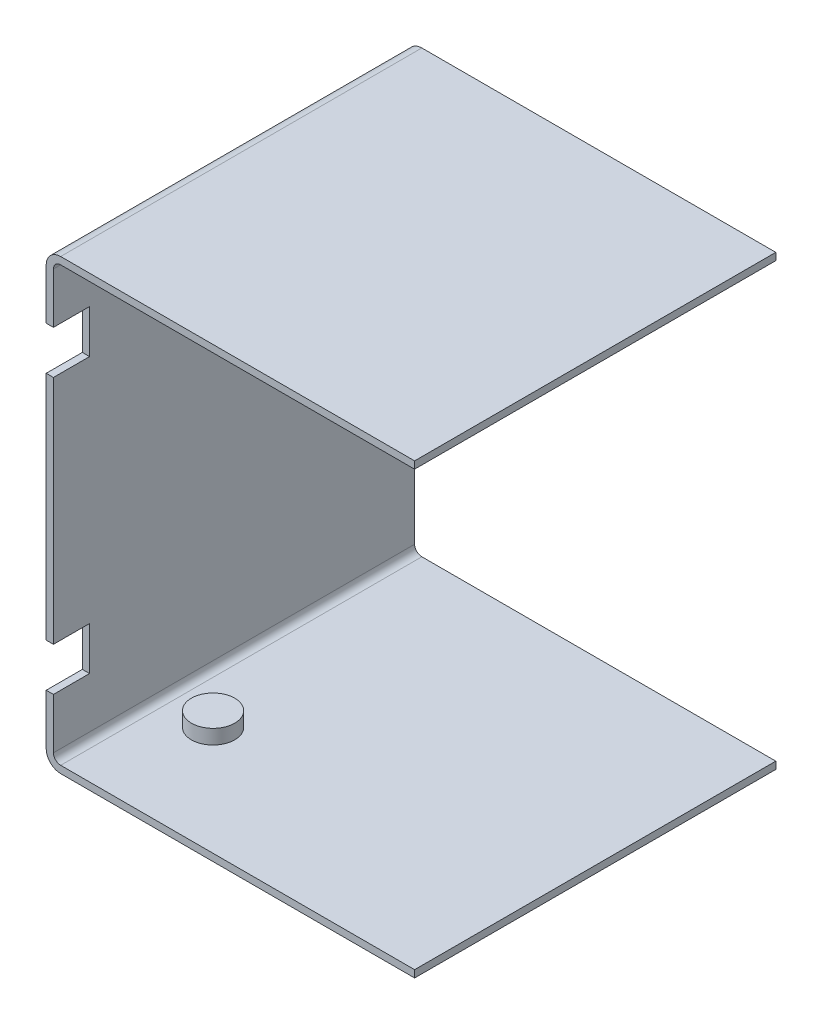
ISO-10303-21;
HEADER;
FILE_DESCRIPTION(('STEP AP214'),'2;1');
FILE_NAME('part.step','',(''),(''),'','','');
FILE_SCHEMA(('AUTOMOTIVE_DESIGN { 1 0 10303 214 1 1 1 1 }'));
ENDSEC;
DATA;
#1=APPLICATION_CONTEXT('core data for automotive mechanical design processes');
#2=APPLICATION_PROTOCOL_DEFINITION('international standard','automotive_design',2000,#1);
#3=PRODUCT_CONTEXT('',#1,'mechanical');
#4=PRODUCT('Part','Part','',(#3));
#5=PRODUCT_RELATED_PRODUCT_CATEGORY('part','',(#4));
#6=PRODUCT_DEFINITION_FORMATION('','',#4);
#7=PRODUCT_DEFINITION_CONTEXT('part definition',#1,'design');
#8=PRODUCT_DEFINITION('design','',#6,#7);
#9=PRODUCT_DEFINITION_SHAPE('','',#8);
#10=(LENGTH_UNIT() NAMED_UNIT(*) SI_UNIT(.MILLI.,.METRE.));
#11=(NAMED_UNIT(*) PLANE_ANGLE_UNIT() SI_UNIT($,.RADIAN.));
#12=(NAMED_UNIT(*) SI_UNIT($,.STERADIAN.) SOLID_ANGLE_UNIT());
#13=UNCERTAINTY_MEASURE_WITH_UNIT(LENGTH_MEASURE(1.E-05),#10,'distance_accuracy_value','');
#14=(GEOMETRIC_REPRESENTATION_CONTEXT(3) GLOBAL_UNCERTAINTY_ASSIGNED_CONTEXT((#13)) GLOBAL_UNIT_ASSIGNED_CONTEXT((#10,
#11,#12)) REPRESENTATION_CONTEXT('',''));
#15=CARTESIAN_POINT('',(0.,0.,0.));
#16=DIRECTION('',(0.,0.,1.));
#17=DIRECTION('',(1.,0.,0.));
#18=AXIS2_PLACEMENT_3D('',#15,#16,#17);
#19=CARTESIAN_POINT('',(-10.,0.,500.));
#20=DIRECTION('',(1.,0.,0.));
#21=DIRECTION('',(0.,0.,-1.));
#22=AXIS2_PLACEMENT_3D('',#19,#20,#21);
#23=PLANE('',#22);
#24=DIRECTION('',(0.,0.,-1.));
#25=VECTOR('',#24,1.);
#26=CARTESIAN_POINT('',(-10.,-160.,500.));
#27=LINE('',#26,#25);
#28=CARTESIAN_POINT('',(-10.,-160.,500.));
#29=VERTEX_POINT('',#28);
#30=CARTESIAN_POINT('',(-10.,-160.,450.));
#31=VERTEX_POINT('',#30);
#32=EDGE_CURVE('E301',#29,#31,#27,.T.);
#33=ORIENTED_EDGE('',*,*,#32,.F.);
#34=DIRECTION('',(0.,-1.,0.));
#35=VECTOR('',#34,1.);
#36=CARTESIAN_POINT('',(-10.,0.,500.));
#37=LINE('',#36,#35);
#38=CARTESIAN_POINT('',(-10.,160.,500.));
#39=VERTEX_POINT('',#38);
#40=EDGE_CURVE('E205',#39,#29,#37,.T.);
#41=ORIENTED_EDGE('',*,*,#40,.F.);
#42=DIRECTION('',(0.,0.,-1.));
#43=VECTOR('',#42,1.);
#44=CARTESIAN_POINT('',(-10.,160.,500.));
#45=LINE('',#44,#43);
#46=CARTESIAN_POINT('',(-10.,160.,450.));
#47=VERTEX_POINT('',#46);
#48=EDGE_CURVE('E52',#39,#47,#45,.T.);
#49=ORIENTED_EDGE('',*,*,#48,.T.);
#50=DIRECTION('',(0.,1.,0.));
#51=VECTOR('',#50,1.);
#52=CARTESIAN_POINT('',(-10.,0.,450.));
#53=LINE('',#52,#51);
#54=CARTESIAN_POINT('',(-10.,220.,450.));
#55=VERTEX_POINT('',#54);
#56=EDGE_CURVE('E236',#47,#55,#53,.T.);
#57=ORIENTED_EDGE('',*,*,#56,.T.);
#58=DIRECTION('',(0.,0.,1.));
#59=VECTOR('',#58,1.);
#60=CARTESIAN_POINT('',(-10.,220.,500.));
#61=LINE('',#60,#59);
#62=CARTESIAN_POINT('',(-10.,220.,500.));
#63=VERTEX_POINT('',#62);
#64=EDGE_CURVE('E239',#55,#63,#61,.T.);
#65=ORIENTED_EDGE('',*,*,#64,.T.);
#66=CARTESIAN_POINT('',(-10.,290.,500.));
#67=VERTEX_POINT('',#66);
#68=EDGE_CURVE('E199',#67,#63,#37,.T.);
#69=ORIENTED_EDGE('',*,*,#68,.F.);
#70=DIRECTION('',(0.,0.,-1.));
#71=VECTOR('',#70,1.);
#72=CARTESIAN_POINT('',(-10.,290.,500.));
#73=LINE('',#72,#71);
#74=CARTESIAN_POINT('',(-10.,290.,0.));
#75=VERTEX_POINT('',#74);
#76=EDGE_CURVE('E357',#67,#75,#73,.T.);
#77=ORIENTED_EDGE('',*,*,#76,.T.);
#78=DIRECTION('',(0.,-1.,0.));
#79=VECTOR('',#78,1.);
#80=CARTESIAN_POINT('',(-10.,0.,0.));
#81=LINE('',#80,#79);
#82=CARTESIAN_POINT('',(-10.,-290.,0.));
#83=VERTEX_POINT('',#82);
#84=EDGE_CURVE('E227',#75,#83,#81,.T.);
#85=ORIENTED_EDGE('',*,*,#84,.T.);
#86=DIRECTION('',(0.,0.,-1.));
#87=VECTOR('',#86,1.);
#88=CARTESIAN_POINT('',(-10.,-290.,500.));
#89=LINE('',#88,#87);
#90=CARTESIAN_POINT('',(-10.,-290.,500.));
#91=VERTEX_POINT('',#90);
#92=EDGE_CURVE('E264',#91,#83,#89,.T.);
#93=ORIENTED_EDGE('',*,*,#92,.F.);
#94=CARTESIAN_POINT('',(-10.,-220.,500.));
#95=VERTEX_POINT('',#94);
#96=EDGE_CURVE('E206',#95,#91,#37,.T.);
#97=ORIENTED_EDGE('',*,*,#96,.F.);
#98=DIRECTION('',(0.,0.,1.));
#99=VECTOR('',#98,1.);
#100=CARTESIAN_POINT('',(-10.,-220.,500.));
#101=LINE('',#100,#99);
#102=CARTESIAN_POINT('',(-10.,-220.,450.));
#103=VERTEX_POINT('',#102);
#104=EDGE_CURVE('E44',#103,#95,#101,.T.);
#105=ORIENTED_EDGE('',*,*,#104,.F.);
#106=DIRECTION('',(0.,-1.,0.));
#107=VECTOR('',#106,1.);
#108=CARTESIAN_POINT('',(-10.,0.,450.));
#109=LINE('',#108,#107);
#110=EDGE_CURVE('E299',#31,#103,#109,.T.);
#111=ORIENTED_EDGE('',*,*,#110,.F.);
#112=EDGE_LOOP('',(#33,#41,#49,#57,#65,#69,#77,#85,#93,#97,#105,#111));
#113=FACE_BOUND('',#112,.T.);
#114=ADVANCED_FACE('F29',(#113),#23,.F.);
#115=CARTESIAN_POINT('',(0.,290.,500.));
#116=DIRECTION('',(-1.,0.,0.));
#117=DIRECTION('',(0.,0.,1.));
#118=AXIS2_PLACEMENT_3D('',#115,#116,#117);
#119=PLANE('',#118);
#120=DIRECTION('',(0.,0.,-1.));
#121=VECTOR('',#120,1.);
#122=CARTESIAN_POINT('',(0.,-160.,500.));
#123=LINE('',#122,#121);
#124=CARTESIAN_POINT('',(0.,-160.,500.));
#125=VERTEX_POINT('',#124);
#126=CARTESIAN_POINT('',(0.,-160.,450.));
#127=VERTEX_POINT('',#126);
#128=EDGE_CURVE('E307',#125,#127,#123,.T.);
#129=ORIENTED_EDGE('',*,*,#128,.T.);
#130=DIRECTION('',(0.,-1.,0.));
#131=VECTOR('',#130,1.);
#132=CARTESIAN_POINT('',(0.,-220.,450.));
#133=LINE('',#132,#131);
#134=CARTESIAN_POINT('',(0.,-220.,450.));
#135=VERTEX_POINT('',#134);
#136=EDGE_CURVE('E184',#127,#135,#133,.T.);
#137=ORIENTED_EDGE('',*,*,#136,.T.);
#138=DIRECTION('',(0.,0.,1.));
#139=VECTOR('',#138,1.);
#140=CARTESIAN_POINT('',(0.,-220.,500.));
#141=LINE('',#140,#139);
#142=CARTESIAN_POINT('',(0.,-220.,500.));
#143=VERTEX_POINT('',#142);
#144=EDGE_CURVE('E170',#135,#143,#141,.T.);
#145=ORIENTED_EDGE('',*,*,#144,.T.);
#146=DIRECTION('',(0.,1.,0.));
#147=VECTOR('',#146,1.);
#148=CARTESIAN_POINT('',(0.,290.,500.));
#149=LINE('',#148,#147);
#150=CARTESIAN_POINT('',(0.,-290.,500.));
#151=VERTEX_POINT('',#150);
#152=EDGE_CURVE('E181',#151,#143,#149,.T.);
#153=ORIENTED_EDGE('',*,*,#152,.F.);
#154=DIRECTION('',(0.,0.,-1.));
#155=VECTOR('',#154,1.);
#156=CARTESIAN_POINT('',(0.,-290.,500.));
#157=LINE('',#156,#155);
#158=CARTESIAN_POINT('',(0.,-290.,0.));
#159=VERTEX_POINT('',#158);
#160=EDGE_CURVE('E262',#151,#159,#157,.T.);
#161=ORIENTED_EDGE('',*,*,#160,.T.);
#162=DIRECTION('',(0.,1.,0.));
#163=VECTOR('',#162,1.);
#164=CARTESIAN_POINT('',(0.,290.,0.));
#165=LINE('',#164,#163);
#166=CARTESIAN_POINT('',(0.,290.,0.));
#167=VERTEX_POINT('',#166);
#168=EDGE_CURVE('E225',#159,#167,#165,.T.);
#169=ORIENTED_EDGE('',*,*,#168,.T.);
#170=DIRECTION('',(0.,0.,-1.));
#171=VECTOR('',#170,1.);
#172=CARTESIAN_POINT('',(0.,290.,500.));
#173=LINE('',#172,#171);
#174=CARTESIAN_POINT('',(0.,290.,500.));
#175=VERTEX_POINT('',#174);
#176=EDGE_CURVE('E379',#175,#167,#173,.T.);
#177=ORIENTED_EDGE('',*,*,#176,.F.);
#178=CARTESIAN_POINT('',(0.,220.,500.));
#179=VERTEX_POINT('',#178);
#180=EDGE_CURVE('E195',#179,#175,#149,.T.);
#181=ORIENTED_EDGE('',*,*,#180,.F.);
#182=DIRECTION('',(0.,0.,1.));
#183=VECTOR('',#182,1.);
#184=CARTESIAN_POINT('',(0.,220.,500.));
#185=LINE('',#184,#183);
#186=CARTESIAN_POINT('',(0.,220.,450.));
#187=VERTEX_POINT('',#186);
#188=EDGE_CURVE('E246',#187,#179,#185,.T.);
#189=ORIENTED_EDGE('',*,*,#188,.F.);
#190=DIRECTION('',(0.,1.,0.));
#191=VECTOR('',#190,1.);
#192=CARTESIAN_POINT('',(0.,220.,450.));
#193=LINE('',#192,#191);
#194=CARTESIAN_POINT('',(0.,160.,450.));
#195=VERTEX_POINT('',#194);
#196=EDGE_CURVE('E249',#195,#187,#193,.T.);
#197=ORIENTED_EDGE('',*,*,#196,.F.);
#198=DIRECTION('',(0.,0.,-1.));
#199=VECTOR('',#198,1.);
#200=CARTESIAN_POINT('',(0.,160.,500.));
#201=LINE('',#200,#199);
#202=CARTESIAN_POINT('',(0.,160.,500.));
#203=VERTEX_POINT('',#202);
#204=EDGE_CURVE('E252',#203,#195,#201,.T.);
#205=ORIENTED_EDGE('',*,*,#204,.F.);
#206=EDGE_CURVE('E193',#125,#203,#149,.T.);
#207=ORIENTED_EDGE('',*,*,#206,.F.);
#208=EDGE_LOOP('',(#129,#137,#145,#153,#161,#169,#177,#181,#189,#197,#205,#207));
#209=FACE_BOUND('',#208,.T.);
#210=ADVANCED_FACE('F179',(#209),#119,.F.);
#211=CARTESIAN_POINT('',(10.,290.,500.));
#212=DIRECTION('',(0.,0.,1.));
#213=DIRECTION('',(1.,0.,0.));
#214=AXIS2_PLACEMENT_3D('',#211,#212,#213);
#215=PLANE('',#214);
#216=ORIENTED_EDGE('',*,*,#40,.T.);
#217=DIRECTION('',(1.,0.,0.));
#218=VECTOR('',#217,1.);
#219=CARTESIAN_POINT('',(10.,-160.,500.));
#220=LINE('',#219,#218);
#221=EDGE_CURVE('E37',#29,#125,#220,.T.);
#222=ORIENTED_EDGE('',*,*,#221,.T.);
#223=ORIENTED_EDGE('',*,*,#206,.T.);
#224=DIRECTION('',(1.,0.,0.));
#225=VECTOR('',#224,1.);
#226=CARTESIAN_POINT('',(10.,160.,500.));
#227=LINE('',#226,#225);
#228=EDGE_CURVE('E402',#39,#203,#227,.T.);
#229=ORIENTED_EDGE('',*,*,#228,.F.);
#230=EDGE_LOOP('',(#216,#222,#223,#229));
#231=FACE_BOUND('',#230,.T.);
#232=ADVANCED_FACE('F330',(#231),#215,.T.);
#233=ORIENTED_EDGE('',*,*,#152,.T.);
#234=DIRECTION('',(-1.,0.,0.));
#235=VECTOR('',#234,1.);
#236=CARTESIAN_POINT('',(10.,-220.,500.));
#237=LINE('',#236,#235);
#238=EDGE_CURVE('E167',#143,#95,#237,.T.);
#239=ORIENTED_EDGE('',*,*,#238,.T.);
#240=ORIENTED_EDGE('',*,*,#96,.T.);
#241=CARTESIAN_POINT('',(9.99999999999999,-290.,500.));
#242=DIRECTION('',(0.,0.,-1.));
#243=DIRECTION('',(-1.,0.,0.));
#244=AXIS2_PLACEMENT_3D('',#241,#242,#243);
#245=CIRCLE('',#244,20.);
#246=CARTESIAN_POINT('',(10.0000000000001,-310.,500.));
#247=VERTEX_POINT('',#246);
#248=EDGE_CURVE('E274',#247,#91,#245,.T.);
#249=ORIENTED_EDGE('',*,*,#248,.F.);
#250=DIRECTION('',(-1.,0.,0.));
#251=VECTOR('',#250,1.);
#252=CARTESIAN_POINT('',(10.0000000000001,-310.,500.));
#253=LINE('',#252,#251);
#254=CARTESIAN_POINT('',(500.,-310.,500.));
#255=VERTEX_POINT('',#254);
#256=EDGE_CURVE('E271',#255,#247,#253,.T.);
#257=ORIENTED_EDGE('',*,*,#256,.F.);
#258=DIRECTION('',(0.,-1.,0.));
#259=VECTOR('',#258,1.);
#260=CARTESIAN_POINT('',(500.,-310.,500.));
#261=LINE('',#260,#259);
#262=CARTESIAN_POINT('',(500.,-300.,500.));
#263=VERTEX_POINT('',#262);
#264=EDGE_CURVE('E281',#263,#255,#261,.T.);
#265=ORIENTED_EDGE('',*,*,#264,.F.);
#266=DIRECTION('',(1.,0.,0.));
#267=VECTOR('',#266,1.);
#268=CARTESIAN_POINT('',(500.,-300.,500.));
#269=LINE('',#268,#267);
#270=CARTESIAN_POINT('',(10.0000000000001,-300.,500.));
#271=VERTEX_POINT('',#270);
#272=EDGE_CURVE('E278',#271,#263,#269,.T.);
#273=ORIENTED_EDGE('',*,*,#272,.F.);
#274=CARTESIAN_POINT('',(10.,-290.,500.));
#275=DIRECTION('',(0.,0.,1.));
#276=DIRECTION('',(1.,0.,0.));
#277=AXIS2_PLACEMENT_3D('',#274,#275,#276);
#278=CIRCLE('',#277,10.);
#279=EDGE_CURVE('E191',#151,#271,#278,.T.);
#280=ORIENTED_EDGE('',*,*,#279,.F.);
#281=EDGE_LOOP('',(#233,#239,#240,#249,#257,#265,#273,#280));
#282=FACE_BOUND('',#281,.T.);
#283=ADVANCED_FACE('F188',(#282),#215,.T.);
#284=CARTESIAN_POINT('',(500.,300.,500.));
#285=DIRECTION('',(0.,1.,0.));
#286=DIRECTION('',(-1.,0.,0.));
#287=AXIS2_PLACEMENT_3D('',#284,#285,#286);
#288=PLANE('',#287);
#289=DIRECTION('',(1.,0.,0.));
#290=VECTOR('',#289,1.);
#291=CARTESIAN_POINT('',(500.,300.,0.));
#292=LINE('',#291,#290);
#293=CARTESIAN_POINT('',(10.0000000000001,300.,0.));
#294=VERTEX_POINT('',#293);
#295=CARTESIAN_POINT('',(500.,300.,0.));
#296=VERTEX_POINT('',#295);
#297=EDGE_CURVE('E221',#294,#296,#292,.T.);
#298=ORIENTED_EDGE('',*,*,#297,.T.);
#299=DIRECTION('',(0.,0.,-1.));
#300=VECTOR('',#299,1.);
#301=CARTESIAN_POINT('',(500.,300.,500.));
#302=LINE('',#301,#300);
#303=CARTESIAN_POINT('',(500.,300.,500.));
#304=VERTEX_POINT('',#303);
#305=EDGE_CURVE('E394',#304,#296,#302,.T.);
#306=ORIENTED_EDGE('',*,*,#305,.F.);
#307=DIRECTION('',(1.,0.,0.));
#308=VECTOR('',#307,1.);
#309=CARTESIAN_POINT('',(500.,300.,500.));
#310=LINE('',#309,#308);
#311=CARTESIAN_POINT('',(10.0000000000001,300.,500.));
#312=VERTEX_POINT('',#311);
#313=EDGE_CURVE('E196',#312,#304,#310,.T.);
#314=ORIENTED_EDGE('',*,*,#313,.F.);
#315=DIRECTION('',(0.,0.,-1.));
#316=VECTOR('',#315,1.);
#317=CARTESIAN_POINT('',(10.0000000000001,300.,500.));
#318=LINE('',#317,#316);
#319=EDGE_CURVE('E385',#312,#294,#318,.T.);
#320=ORIENTED_EDGE('',*,*,#319,.T.);
#321=EDGE_LOOP('',(#298,#306,#314,#320));
#322=FACE_BOUND('',#321,.T.);
#323=CARTESIAN_POINT('',(69.9999999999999,300.,349.));
#324=DIRECTION('',(0.,1.,0.));
#325=DIRECTION('',(-1.,0.,0.));
#326=AXIS2_PLACEMENT_3D('',#323,#324,#325);
#327=CIRCLE('',#326,30.);
#328=CARTESIAN_POINT('',(39.9999999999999,300.,349.));
#329=VERTEX_POINT('',#328);
#330=EDGE_CURVE('E175',#329,#329,#327,.F.);
#331=ORIENTED_EDGE('',*,*,#330,.F.);
#332=EDGE_LOOP('',(#331));
#333=FACE_BOUND('',#332,.T.);
#334=ADVANCED_FACE('F391',(#322,#333),#288,.F.);
#335=DIRECTION('',(-1.,0.,0.));
#336=VECTOR('',#335,1.);
#337=CARTESIAN_POINT('',(10.,220.,500.));
#338=LINE('',#337,#336);
#339=EDGE_CURVE('E404',#179,#63,#338,.T.);
#340=ORIENTED_EDGE('',*,*,#339,.F.);
#341=ORIENTED_EDGE('',*,*,#180,.T.);
#342=CARTESIAN_POINT('',(10.,290.,500.));
#343=DIRECTION('',(0.,0.,-1.));
#344=DIRECTION('',(1.,0.,0.));
#345=AXIS2_PLACEMENT_3D('',#342,#343,#344);
#346=CIRCLE('',#345,10.);
#347=EDGE_CURVE('E192',#175,#312,#346,.T.);
#348=ORIENTED_EDGE('',*,*,#347,.T.);
#349=ORIENTED_EDGE('',*,*,#313,.T.);
#350=DIRECTION('',(0.,1.,0.));
#351=VECTOR('',#350,1.);
#352=CARTESIAN_POINT('',(500.,310.,500.));
#353=LINE('',#352,#351);
#354=CARTESIAN_POINT('',(500.,310.,500.));
#355=VERTEX_POINT('',#354);
#356=EDGE_CURVE('E216',#304,#355,#353,.T.);
#357=ORIENTED_EDGE('',*,*,#356,.T.);
#358=DIRECTION('',(-1.,0.,0.));
#359=VECTOR('',#358,1.);
#360=CARTESIAN_POINT('',(10.0000000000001,310.,500.));
#361=LINE('',#360,#359);
#362=CARTESIAN_POINT('',(10.0000000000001,310.,500.));
#363=VERTEX_POINT('',#362);
#364=EDGE_CURVE('E213',#355,#363,#361,.T.);
#365=ORIENTED_EDGE('',*,*,#364,.T.);
#366=CARTESIAN_POINT('',(9.99999999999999,290.,500.));
#367=DIRECTION('',(0.,0.,1.));
#368=DIRECTION('',(-1.,0.,0.));
#369=AXIS2_PLACEMENT_3D('',#366,#367,#368);
#370=CIRCLE('',#369,20.);
#371=EDGE_CURVE('E210',#363,#67,#370,.T.);
#372=ORIENTED_EDGE('',*,*,#371,.T.);
#373=ORIENTED_EDGE('',*,*,#68,.T.);
#374=EDGE_LOOP('',(#340,#341,#348,#349,#357,#365,#372,#373));
#375=FACE_BOUND('',#374,.T.);
#376=ADVANCED_FACE('F345',(#375),#215,.T.);
#377=CARTESIAN_POINT('',(500.,310.,500.));
#378=DIRECTION('',(-1.,0.,0.));
#379=DIRECTION('',(0.,-1.,0.));
#380=AXIS2_PLACEMENT_3D('',#377,#378,#379);
#381=PLANE('',#380);
#382=DIRECTION('',(0.,1.,0.));
#383=VECTOR('',#382,1.);
#384=CARTESIAN_POINT('',(500.,310.,0.));
#385=LINE('',#384,#383);
#386=CARTESIAN_POINT('',(500.,310.,0.));
#387=VERTEX_POINT('',#386);
#388=EDGE_CURVE('E233',#296,#387,#385,.T.);
#389=ORIENTED_EDGE('',*,*,#388,.T.);
#390=DIRECTION('',(0.,0.,-1.));
#391=VECTOR('',#390,1.);
#392=CARTESIAN_POINT('',(500.,310.,500.));
#393=LINE('',#392,#391);
#394=EDGE_CURVE('E352',#355,#387,#393,.T.);
#395=ORIENTED_EDGE('',*,*,#394,.F.);
#396=ORIENTED_EDGE('',*,*,#356,.F.);
#397=ORIENTED_EDGE('',*,*,#305,.T.);
#398=EDGE_LOOP('',(#389,#395,#396,#397));
#399=FACE_BOUND('',#398,.T.);
#400=ADVANCED_FACE('F31',(#399),#381,.F.);
#401=CARTESIAN_POINT('',(10.0000000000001,310.,500.));
#402=DIRECTION('',(0.,-1.,0.));
#403=DIRECTION('',(0.,0.,-1.));
#404=AXIS2_PLACEMENT_3D('',#401,#402,#403);
#405=PLANE('',#404);
#406=DIRECTION('',(-1.,0.,0.));
#407=VECTOR('',#406,1.);
#408=CARTESIAN_POINT('',(10.0000000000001,310.,0.));
#409=LINE('',#408,#407);
#410=CARTESIAN_POINT('',(10.0000000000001,310.,0.));
#411=VERTEX_POINT('',#410);
#412=EDGE_CURVE('E231',#387,#411,#409,.T.);
#413=ORIENTED_EDGE('',*,*,#412,.T.);
#414=DIRECTION('',(0.,0.,-1.));
#415=VECTOR('',#414,1.);
#416=CARTESIAN_POINT('',(10.0000000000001,310.,500.));
#417=LINE('',#416,#415);
#418=EDGE_CURVE('E350',#363,#411,#417,.T.);
#419=ORIENTED_EDGE('',*,*,#418,.F.);
#420=ORIENTED_EDGE('',*,*,#364,.F.);
#421=ORIENTED_EDGE('',*,*,#394,.T.);
#422=EDGE_LOOP('',(#413,#419,#420,#421));
#423=FACE_BOUND('',#422,.T.);
#424=ADVANCED_FACE('F338',(#423),#405,.F.);
#425=CARTESIAN_POINT('',(9.99999999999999,290.,500.));
#426=DIRECTION('',(0.,0.,-1.));
#427=DIRECTION('',(-1.,0.,0.));
#428=AXIS2_PLACEMENT_3D('',#425,#426,#427);
#429=CYLINDRICAL_SURFACE('',#428,20.);
#430=CARTESIAN_POINT('',(9.99999999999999,290.,0.));
#431=DIRECTION('',(0.,0.,1.));
#432=DIRECTION('',(-1.,0.,0.));
#433=AXIS2_PLACEMENT_3D('',#430,#431,#432);
#434=CIRCLE('',#433,20.);
#435=EDGE_CURVE('E229',#411,#75,#434,.T.);
#436=ORIENTED_EDGE('',*,*,#435,.T.);
#437=ORIENTED_EDGE('',*,*,#76,.F.);
#438=ORIENTED_EDGE('',*,*,#371,.F.);
#439=ORIENTED_EDGE('',*,*,#418,.T.);
#440=EDGE_LOOP('',(#436,#437,#438,#439));
#441=FACE_BOUND('',#440,.T.);
#442=ADVANCED_FACE('F335',(#441),#429,.T.);
#443=CARTESIAN_POINT('',(10.,290.,500.));
#444=DIRECTION('',(0.,0.,-1.));
#445=DIRECTION('',(-1.,0.,0.));
#446=AXIS2_PLACEMENT_3D('',#443,#444,#445);
#447=CYLINDRICAL_SURFACE('',#446,10.);
#448=CARTESIAN_POINT('',(10.,290.,0.));
#449=DIRECTION('',(0.,0.,-1.));
#450=DIRECTION('',(1.,0.,0.));
#451=AXIS2_PLACEMENT_3D('',#448,#449,#450);
#452=CIRCLE('',#451,10.);
#453=EDGE_CURVE('E223',#167,#294,#452,.T.);
#454=ORIENTED_EDGE('',*,*,#453,.T.);
#455=ORIENTED_EDGE('',*,*,#319,.F.);
#456=ORIENTED_EDGE('',*,*,#347,.F.);
#457=ORIENTED_EDGE('',*,*,#176,.T.);
#458=EDGE_LOOP('',(#454,#455,#456,#457));
#459=FACE_BOUND('',#458,.T.);
#460=ADVANCED_FACE('F337',(#459),#447,.F.);
#461=CARTESIAN_POINT('',(10.,290.,0.));
#462=DIRECTION('',(0.,0.,1.));
#463=DIRECTION('',(1.,0.,0.));
#464=AXIS2_PLACEMENT_3D('',#461,#462,#463);
#465=PLANE('',#464);
#466=ORIENTED_EDGE('',*,*,#388,.F.);
#467=ORIENTED_EDGE('',*,*,#297,.F.);
#468=ORIENTED_EDGE('',*,*,#453,.F.);
#469=ORIENTED_EDGE('',*,*,#168,.F.);
#470=CARTESIAN_POINT('',(10.,-290.,0.));
#471=DIRECTION('',(0.,0.,1.));
#472=DIRECTION('',(1.,0.,0.));
#473=AXIS2_PLACEMENT_3D('',#470,#471,#472);
#474=CIRCLE('',#473,10.);
#475=CARTESIAN_POINT('',(10.0000000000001,-300.,0.));
#476=VERTEX_POINT('',#475);
#477=EDGE_CURVE('E290',#159,#476,#474,.T.);
#478=ORIENTED_EDGE('',*,*,#477,.T.);
#479=DIRECTION('',(1.,0.,0.));
#480=VECTOR('',#479,1.);
#481=CARTESIAN_POINT('',(500.,-300.,0.));
#482=LINE('',#481,#480);
#483=CARTESIAN_POINT('',(500.,-300.,0.));
#484=VERTEX_POINT('',#483);
#485=EDGE_CURVE('E293',#476,#484,#482,.T.);
#486=ORIENTED_EDGE('',*,*,#485,.T.);
#487=DIRECTION('',(0.,-1.,0.));
#488=VECTOR('',#487,1.);
#489=CARTESIAN_POINT('',(500.,-310.,0.));
#490=LINE('',#489,#488);
#491=CARTESIAN_POINT('',(500.,-310.,0.));
#492=VERTEX_POINT('',#491);
#493=EDGE_CURVE('E296',#484,#492,#490,.T.);
#494=ORIENTED_EDGE('',*,*,#493,.T.);
#495=DIRECTION('',(-1.,0.,0.));
#496=VECTOR('',#495,1.);
#497=CARTESIAN_POINT('',(10.0000000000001,-310.,0.));
#498=LINE('',#497,#496);
#499=CARTESIAN_POINT('',(10.0000000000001,-310.,0.));
#500=VERTEX_POINT('',#499);
#501=EDGE_CURVE('E284',#492,#500,#498,.T.);
#502=ORIENTED_EDGE('',*,*,#501,.T.);
#503=CARTESIAN_POINT('',(9.99999999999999,-290.,0.));
#504=DIRECTION('',(0.,0.,-1.));
#505=DIRECTION('',(-1.,0.,0.));
#506=AXIS2_PLACEMENT_3D('',#503,#504,#505);
#507=CIRCLE('',#506,20.);
#508=EDGE_CURVE('E287',#500,#83,#507,.T.);
#509=ORIENTED_EDGE('',*,*,#508,.T.);
#510=ORIENTED_EDGE('',*,*,#84,.F.);
#511=ORIENTED_EDGE('',*,*,#435,.F.);
#512=ORIENTED_EDGE('',*,*,#412,.F.);
#513=EDGE_LOOP('',(#466,#467,#468,#469,#478,#486,#494,#502,#509,#510,#511,#512));
#514=FACE_BOUND('',#513,.T.);
#515=ADVANCED_FACE('F360',(#514),#465,.F.);
#516=CARTESIAN_POINT('',(-1000.,220.,450.));
#517=DIRECTION('',(0.,0.,-1.));
#518=DIRECTION('',(0.,1.,0.));
#519=AXIS2_PLACEMENT_3D('',#516,#517,#518);
#520=PLANE('',#519);
#521=DIRECTION('',(1.,0.,0.));
#522=VECTOR('',#521,1.);
#523=CARTESIAN_POINT('',(-1000.,160.,450.));
#524=LINE('',#523,#522);
#525=EDGE_CURVE('E244',#47,#195,#524,.T.);
#526=ORIENTED_EDGE('',*,*,#525,.T.);
#527=ORIENTED_EDGE('',*,*,#196,.T.);
#528=DIRECTION('',(1.,0.,0.));
#529=VECTOR('',#528,1.);
#530=CARTESIAN_POINT('',(-1000.,220.,450.));
#531=LINE('',#530,#529);
#532=EDGE_CURVE('E243',#55,#187,#531,.T.);
#533=ORIENTED_EDGE('',*,*,#532,.F.);
#534=ORIENTED_EDGE('',*,*,#56,.F.);
#535=EDGE_LOOP('',(#526,#527,#533,#534));
#536=FACE_BOUND('',#535,.T.);
#537=ADVANCED_FACE('F452',(#536),#520,.F.);
#538=CARTESIAN_POINT('',(-1000.,220.,500.));
#539=DIRECTION('',(0.,1.,0.));
#540=DIRECTION('',(0.,0.,1.));
#541=AXIS2_PLACEMENT_3D('',#538,#539,#540);
#542=PLANE('',#541);
#543=ORIENTED_EDGE('',*,*,#532,.T.);
#544=ORIENTED_EDGE('',*,*,#188,.T.);
#545=ORIENTED_EDGE('',*,*,#339,.T.);
#546=ORIENTED_EDGE('',*,*,#64,.F.);
#547=EDGE_LOOP('',(#543,#544,#545,#546));
#548=FACE_BOUND('',#547,.T.);
#549=ADVANCED_FACE('F449',(#548),#542,.F.);
#550=CARTESIAN_POINT('',(-1000.,160.,500.));
#551=DIRECTION('',(0.,-1.,0.));
#552=DIRECTION('',(0.,0.,-1.));
#553=AXIS2_PLACEMENT_3D('',#550,#551,#552);
#554=PLANE('',#553);
#555=ORIENTED_EDGE('',*,*,#228,.T.);
#556=ORIENTED_EDGE('',*,*,#204,.T.);
#557=ORIENTED_EDGE('',*,*,#525,.F.);
#558=ORIENTED_EDGE('',*,*,#48,.F.);
#559=EDGE_LOOP('',(#555,#556,#557,#558));
#560=FACE_BOUND('',#559,.T.);
#561=ADVANCED_FACE('F415',(#560),#554,.F.);
#562=CARTESIAN_POINT('',(69.9999999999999,280.,349.));
#563=DIRECTION('',(0.,1.,0.));
#564=DIRECTION('',(-1.,0.,0.));
#565=AXIS2_PLACEMENT_3D('',#562,#563,#564);
#566=CYLINDRICAL_SURFACE('',#565,30.);
#567=CARTESIAN_POINT('',(69.9999999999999,280.,349.));
#568=DIRECTION('',(0.,-1.,0.));
#569=DIRECTION('',(1.,0.,0.));
#570=AXIS2_PLACEMENT_3D('',#567,#568,#569);
#571=CIRCLE('',#570,30.);
#572=CARTESIAN_POINT('',(99.9999999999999,280.,349.));
#573=VERTEX_POINT('',#572);
#574=EDGE_CURVE('E255',#573,#573,#571,.T.);
#575=ORIENTED_EDGE('',*,*,#574,.F.);
#576=EDGE_LOOP('',(#575));
#577=FACE_BOUND('',#576,.T.);
#578=ORIENTED_EDGE('',*,*,#330,.T.);
#579=EDGE_LOOP('',(#578));
#580=FACE_BOUND('',#579,.T.);
#581=ADVANCED_FACE('F444',(#577,#580),#566,.T.);
#582=CARTESIAN_POINT('',(69.9999999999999,280.,349.));
#583=DIRECTION('',(0.,-1.,0.));
#584=DIRECTION('',(1.,0.,0.));
#585=AXIS2_PLACEMENT_3D('',#582,#583,#584);
#586=PLANE('',#585);
#587=ORIENTED_EDGE('',*,*,#574,.T.);
#588=EDGE_LOOP('',(#587));
#589=FACE_BOUND('',#588,.T.);
#590=ADVANCED_FACE('F441',(#589),#586,.T.);
#591=CARTESIAN_POINT('',(500.,-310.,500.));
#592=DIRECTION('',(1.,0.,0.));
#593=DIRECTION('',(0.,1.,0.));
#594=AXIS2_PLACEMENT_3D('',#591,#592,#593);
#595=PLANE('',#594);
#596=ORIENTED_EDGE('',*,*,#493,.F.);
#597=DIRECTION('',(0.,0.,-1.));
#598=VECTOR('',#597,1.);
#599=CARTESIAN_POINT('',(500.,-300.,500.));
#600=LINE('',#599,#598);
#601=EDGE_CURVE('E258',#263,#484,#600,.T.);
#602=ORIENTED_EDGE('',*,*,#601,.F.);
#603=ORIENTED_EDGE('',*,*,#264,.T.);
#604=DIRECTION('',(0.,0.,-1.));
#605=VECTOR('',#604,1.);
#606=CARTESIAN_POINT('',(500.,-310.,500.));
#607=LINE('',#606,#605);
#608=EDGE_CURVE('E269',#255,#492,#607,.T.);
#609=ORIENTED_EDGE('',*,*,#608,.T.);
#610=EDGE_LOOP('',(#596,#602,#603,#609));
#611=FACE_BOUND('',#610,.T.);
#612=ADVANCED_FACE('F371',(#611),#595,.T.);
#613=CARTESIAN_POINT('',(500.,-300.,500.));
#614=DIRECTION('',(0.,1.,0.));
#615=DIRECTION('',(-1.,0.,0.));
#616=AXIS2_PLACEMENT_3D('',#613,#614,#615);
#617=PLANE('',#616);
#618=CARTESIAN_POINT('',(69.9999999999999,-300.,349.));
#619=DIRECTION('',(0.,1.,0.));
#620=DIRECTION('',(-1.,0.,0.));
#621=AXIS2_PLACEMENT_3D('',#618,#619,#620);
#622=CIRCLE('',#621,30.);
#623=CARTESIAN_POINT('',(39.9999999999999,-300.,349.));
#624=VERTEX_POINT('',#623);
#625=EDGE_CURVE('E11',#624,#624,#622,.T.);
#626=ORIENTED_EDGE('',*,*,#625,.F.);
#627=EDGE_LOOP('',(#626));
#628=FACE_BOUND('',#627,.T.);
#629=ORIENTED_EDGE('',*,*,#485,.F.);
#630=DIRECTION('',(0.,0.,-1.));
#631=VECTOR('',#630,1.);
#632=CARTESIAN_POINT('',(10.0000000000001,-300.,500.));
#633=LINE('',#632,#631);
#634=EDGE_CURVE('E260',#271,#476,#633,.T.);
#635=ORIENTED_EDGE('',*,*,#634,.F.);
#636=ORIENTED_EDGE('',*,*,#272,.T.);
#637=ORIENTED_EDGE('',*,*,#601,.T.);
#638=EDGE_LOOP('',(#629,#635,#636,#637));
#639=FACE_BOUND('',#638,.T.);
#640=ADVANCED_FACE('F374',(#628,#639),#617,.T.);
#641=CARTESIAN_POINT('',(10.,-290.,500.));
#642=DIRECTION('',(0.,0.,-1.));
#643=DIRECTION('',(-1.,0.,0.));
#644=AXIS2_PLACEMENT_3D('',#641,#642,#643);
#645=CYLINDRICAL_SURFACE('',#644,10.);
#646=ORIENTED_EDGE('',*,*,#477,.F.);
#647=ORIENTED_EDGE('',*,*,#160,.F.);
#648=ORIENTED_EDGE('',*,*,#279,.T.);
#649=ORIENTED_EDGE('',*,*,#634,.T.);
#650=EDGE_LOOP('',(#646,#647,#648,#649));
#651=FACE_BOUND('',#650,.T.);
#652=ADVANCED_FACE('F377',(#651),#645,.F.);
#653=CARTESIAN_POINT('',(9.99999999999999,-290.,500.));
#654=DIRECTION('',(0.,0.,-1.));
#655=DIRECTION('',(-1.,0.,0.));
#656=AXIS2_PLACEMENT_3D('',#653,#654,#655);
#657=CYLINDRICAL_SURFACE('',#656,20.);
#658=ORIENTED_EDGE('',*,*,#508,.F.);
#659=DIRECTION('',(0.,0.,-1.));
#660=VECTOR('',#659,1.);
#661=CARTESIAN_POINT('',(10.0000000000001,-310.,500.));
#662=LINE('',#661,#660);
#663=EDGE_CURVE('E267',#247,#500,#662,.T.);
#664=ORIENTED_EDGE('',*,*,#663,.F.);
#665=ORIENTED_EDGE('',*,*,#248,.T.);
#666=ORIENTED_EDGE('',*,*,#92,.T.);
#667=EDGE_LOOP('',(#658,#664,#665,#666));
#668=FACE_BOUND('',#667,.T.);
#669=ADVANCED_FACE('F363',(#668),#657,.T.);
#670=CARTESIAN_POINT('',(10.0000000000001,-310.,500.));
#671=DIRECTION('',(0.,-1.,0.));
#672=DIRECTION('',(0.,0.,-1.));
#673=AXIS2_PLACEMENT_3D('',#670,#671,#672);
#674=PLANE('',#673);
#675=ORIENTED_EDGE('',*,*,#501,.F.);
#676=ORIENTED_EDGE('',*,*,#608,.F.);
#677=ORIENTED_EDGE('',*,*,#256,.T.);
#678=ORIENTED_EDGE('',*,*,#663,.T.);
#679=EDGE_LOOP('',(#675,#676,#677,#678));
#680=FACE_BOUND('',#679,.T.);
#681=ADVANCED_FACE('F368',(#680),#674,.T.);
#682=CARTESIAN_POINT('',(-1000.,-220.,450.));
#683=DIRECTION('',(0.,0.,1.));
#684=DIRECTION('',(0.,-1.,0.));
#685=AXIS2_PLACEMENT_3D('',#682,#683,#684);
#686=PLANE('',#685);
#687=ORIENTED_EDGE('',*,*,#110,.T.);
#688=DIRECTION('',(1.,0.,0.));
#689=VECTOR('',#688,1.);
#690=CARTESIAN_POINT('',(-1000.,-220.,450.));
#691=LINE('',#690,#689);
#692=EDGE_CURVE('E305',#103,#135,#691,.T.);
#693=ORIENTED_EDGE('',*,*,#692,.T.);
#694=ORIENTED_EDGE('',*,*,#136,.F.);
#695=DIRECTION('',(1.,0.,0.));
#696=VECTOR('',#695,1.);
#697=CARTESIAN_POINT('',(-1000.,-160.,450.));
#698=LINE('',#697,#696);
#699=EDGE_CURVE('E304',#31,#127,#698,.T.);
#700=ORIENTED_EDGE('',*,*,#699,.F.);
#701=EDGE_LOOP('',(#687,#693,#694,#700));
#702=FACE_BOUND('',#701,.T.);
#703=ADVANCED_FACE('F420',(#702),#686,.T.);
#704=CARTESIAN_POINT('',(-1000.,-160.,500.));
#705=DIRECTION('',(0.,-1.,0.));
#706=DIRECTION('',(0.,0.,-1.));
#707=AXIS2_PLACEMENT_3D('',#704,#705,#706);
#708=PLANE('',#707);
#709=ORIENTED_EDGE('',*,*,#32,.T.);
#710=ORIENTED_EDGE('',*,*,#699,.T.);
#711=ORIENTED_EDGE('',*,*,#128,.F.);
#712=ORIENTED_EDGE('',*,*,#221,.F.);
#713=EDGE_LOOP('',(#709,#710,#711,#712));
#714=FACE_BOUND('',#713,.T.);
#715=ADVANCED_FACE('F418',(#714),#708,.T.);
#716=CARTESIAN_POINT('',(-1000.,-220.,500.));
#717=DIRECTION('',(0.,1.,0.));
#718=DIRECTION('',(0.,0.,1.));
#719=AXIS2_PLACEMENT_3D('',#716,#717,#718);
#720=PLANE('',#719);
#721=ORIENTED_EDGE('',*,*,#104,.T.);
#722=ORIENTED_EDGE('',*,*,#238,.F.);
#723=ORIENTED_EDGE('',*,*,#144,.F.);
#724=ORIENTED_EDGE('',*,*,#692,.F.);
#725=EDGE_LOOP('',(#721,#722,#723,#724));
#726=FACE_BOUND('',#725,.T.);
#727=ADVANCED_FACE('F169',(#726),#720,.T.);
#728=CARTESIAN_POINT('',(69.9999999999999,-280.,349.));
#729=DIRECTION('',(0.,-1.,0.));
#730=DIRECTION('',(1.,0.,0.));
#731=AXIS2_PLACEMENT_3D('',#728,#729,#730);
#732=CYLINDRICAL_SURFACE('',#731,30.);
#733=CARTESIAN_POINT('',(69.9999999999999,-280.,349.));
#734=DIRECTION('',(0.,-1.,0.));
#735=DIRECTION('',(1.,0.,0.));
#736=AXIS2_PLACEMENT_3D('',#733,#734,#735);
#737=CIRCLE('',#736,30.);
#738=CARTESIAN_POINT('',(99.9999999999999,-280.,349.));
#739=VERTEX_POINT('',#738);
#740=EDGE_CURVE('E185',#739,#739,#737,.T.);
#741=ORIENTED_EDGE('',*,*,#740,.T.);
#742=EDGE_LOOP('',(#741));
#743=FACE_BOUND('',#742,.T.);
#744=ORIENTED_EDGE('',*,*,#625,.T.);
#745=EDGE_LOOP('',(#744));
#746=FACE_BOUND('',#745,.T.);
#747=ADVANCED_FACE('F314',(#743,#746),#732,.T.);
#748=CARTESIAN_POINT('',(69.9999999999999,-280.,349.));
#749=DIRECTION('',(0.,1.,0.));
#750=DIRECTION('',(1.,0.,0.));
#751=AXIS2_PLACEMENT_3D('',#748,#749,#750);
#752=PLANE('',#751);
#753=ORIENTED_EDGE('',*,*,#740,.F.);
#754=EDGE_LOOP('',(#753));
#755=FACE_BOUND('',#754,.T.);
#756=ADVANCED_FACE('F317',(#755),#752,.T.);
#757=CLOSED_SHELL('',(#114,#210,#232,#283,#334,#376,#400,#424,#442,#460,#515,#537,#549,#561,
#581,#590,#612,#640,#652,#669,#681,#703,#715,#727,#747,#756));
#758=MANIFOLD_SOLID_BREP('B2',#757);
#759=ADVANCED_BREP_SHAPE_REPRESENTATION('',(#18,#758),#14);
#760=SHAPE_DEFINITION_REPRESENTATION(#9,#759);
ENDSEC;
END-ISO-10303-21;
